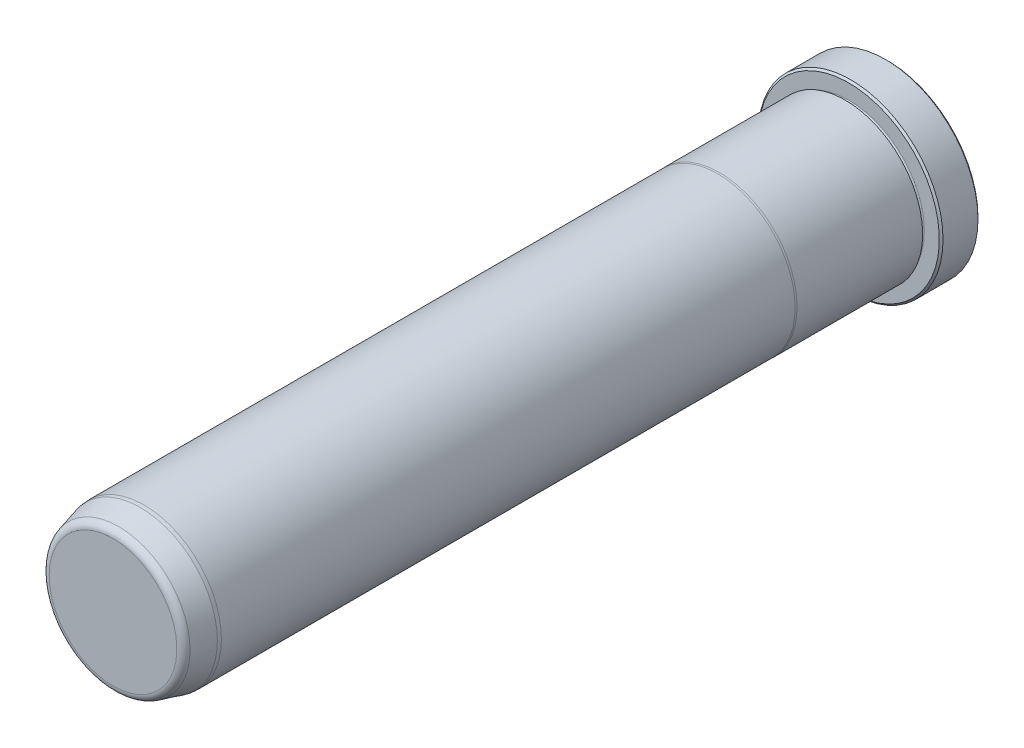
ISO-10303-21;
HEADER;
FILE_DESCRIPTION(('STEP AP214'),'2;1');
FILE_NAME('part.step','',(''),(''),'','','');
FILE_SCHEMA(('AUTOMOTIVE_DESIGN { 1 0 10303 214 1 1 1 1 }'));
ENDSEC;
DATA;
#1=APPLICATION_CONTEXT('core data for automotive mechanical design processes');
#2=APPLICATION_PROTOCOL_DEFINITION('international standard','automotive_design',2000,#1);
#3=PRODUCT_CONTEXT('',#1,'mechanical');
#4=PRODUCT('Part','Part','',(#3));
#5=PRODUCT_RELATED_PRODUCT_CATEGORY('part','',(#4));
#6=PRODUCT_DEFINITION_FORMATION('','',#4);
#7=PRODUCT_DEFINITION_CONTEXT('part definition',#1,'design');
#8=PRODUCT_DEFINITION('design','',#6,#7);
#9=PRODUCT_DEFINITION_SHAPE('','',#8);
#10=(LENGTH_UNIT() NAMED_UNIT(*) SI_UNIT(.MILLI.,.METRE.));
#11=(NAMED_UNIT(*) PLANE_ANGLE_UNIT() SI_UNIT($,.RADIAN.));
#12=(NAMED_UNIT(*) SI_UNIT($,.STERADIAN.) SOLID_ANGLE_UNIT());
#13=UNCERTAINTY_MEASURE_WITH_UNIT(LENGTH_MEASURE(1.E-05),#10,'distance_accuracy_value','');
#14=(GEOMETRIC_REPRESENTATION_CONTEXT(3) GLOBAL_UNCERTAINTY_ASSIGNED_CONTEXT((#13)) GLOBAL_UNIT_ASSIGNED_CONTEXT((#10,
#11,#12)) REPRESENTATION_CONTEXT('',''));
#15=CARTESIAN_POINT('',(0.,0.,0.));
#16=DIRECTION('',(0.,0.,1.));
#17=DIRECTION('',(1.,0.,0.));
#18=AXIS2_PLACEMENT_3D('',#15,#16,#17);
#19=CARTESIAN_POINT('',(0.,0.,0.));
#20=DIRECTION('',(0.,0.,1.));
#21=DIRECTION('',(1.,0.,0.));
#22=AXIS2_PLACEMENT_3D('',#19,#20,#21);
#23=PLANE('',#22);
#24=CARTESIAN_POINT('',(0.,0.,0.));
#25=DIRECTION('',(0.,0.,1.));
#26=DIRECTION('',(1.,0.,0.));
#27=AXIS2_PLACEMENT_3D('',#24,#25,#26);
#28=CIRCLE('',#27,18.542);
#29=CARTESIAN_POINT('',(18.542,0.,0.));
#30=VERTEX_POINT('',#29);
#31=EDGE_CURVE('E37',#30,#30,#28,.F.);
#32=ORIENTED_EDGE('',*,*,#31,.T.);
#33=EDGE_LOOP('',(#32));
#34=FACE_BOUND('',#33,.T.);
#35=ADVANCED_FACE('F30',(#34),#23,.F.);
#36=CARTESIAN_POINT('',(0.,0.,0.));
#37=DIRECTION('',(0.,0.,1.));
#38=DIRECTION('',(1.,0.,0.));
#39=AXIS2_PLACEMENT_3D('',#36,#37,#38);
#40=CYLINDRICAL_SURFACE('',#39,18.923);
#41=CARTESIAN_POINT('',(0.,0.,0.381000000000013));
#42=DIRECTION('',(0.,0.,1.));
#43=DIRECTION('',(1.,0.,0.));
#44=AXIS2_PLACEMENT_3D('',#41,#42,#43);
#45=CIRCLE('',#44,18.923);
#46=CARTESIAN_POINT('',(18.923,0.,0.381000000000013));
#47=VERTEX_POINT('',#46);
#48=EDGE_CURVE('E41',#47,#47,#45,.T.);
#49=ORIENTED_EDGE('',*,*,#48,.T.);
#50=EDGE_LOOP('',(#49));
#51=FACE_BOUND('',#50,.T.);
#52=CARTESIAN_POINT('',(0.,0.,7.54380000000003));
#53=DIRECTION('',(0.,0.,-1.));
#54=DIRECTION('',(-1.,0.,0.));
#55=AXIS2_PLACEMENT_3D('',#52,#53,#54);
#56=CIRCLE('',#55,18.923);
#57=CARTESIAN_POINT('',(-18.923,0.,7.54380000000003));
#58=VERTEX_POINT('',#57);
#59=EDGE_CURVE('E45',#58,#58,#56,.T.);
#60=ORIENTED_EDGE('',*,*,#59,.T.);
#61=EDGE_LOOP('',(#60));
#62=FACE_BOUND('',#61,.T.);
#63=ADVANCED_FACE('F118',(#51,#62),#40,.T.);
#64=CARTESIAN_POINT('',(0.,18.923,7.9248));
#65=DIRECTION('',(0.,0.,-1.));
#66=DIRECTION('',(-1.,0.,0.));
#67=AXIS2_PLACEMENT_3D('',#64,#65,#66);
#68=PLANE('',#67);
#69=CARTESIAN_POINT('',(0.,0.,7.9248));
#70=DIRECTION('',(0.,0.,-1.));
#71=DIRECTION('',(-1.,0.,0.));
#72=AXIS2_PLACEMENT_3D('',#69,#70,#71);
#73=CIRCLE('',#72,18.542);
#74=CARTESIAN_POINT('',(-18.542,0.,7.9248));
#75=VERTEX_POINT('',#74);
#76=EDGE_CURVE('E10',#75,#75,#73,.F.);
#77=ORIENTED_EDGE('',*,*,#76,.T.);
#78=EDGE_LOOP('',(#77));
#79=FACE_BOUND('',#78,.T.);
#80=CARTESIAN_POINT('',(0.,0.,7.9248));
#81=DIRECTION('',(0.,0.,1.));
#82=DIRECTION('',(1.,0.,0.));
#83=AXIS2_PLACEMENT_3D('',#80,#81,#82);
#84=CIRCLE('',#83,15.4813);
#85=CARTESIAN_POINT('',(15.4813,0.,7.9248));
#86=VERTEX_POINT('',#85);
#87=EDGE_CURVE('E56',#86,#86,#84,.T.);
#88=ORIENTED_EDGE('',*,*,#87,.F.);
#89=EDGE_LOOP('',(#88));
#90=FACE_BOUND('',#89,.T.);
#91=ADVANCED_FACE('F113',(#79,#90),#68,.F.);
#92=CARTESIAN_POINT('',(0.,0.,8.3058));
#93=DIRECTION('',(0.,0.,1.));
#94=DIRECTION('',(1.,0.,0.));
#95=AXIS2_PLACEMENT_3D('',#92,#93,#94);
#96=TOROIDAL_SURFACE('',#95,15.4813,0.381000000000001);
#97=CARTESIAN_POINT('',(0.,0.,8.6868));
#98=DIRECTION('',(0.,0.,1.));
#99=DIRECTION('',(1.,0.,0.));
#100=AXIS2_PLACEMENT_3D('',#97,#98,#99);
#101=CIRCLE('',#100,15.4813);
#102=CARTESIAN_POINT('',(15.4813,0.,8.6868));
#103=VERTEX_POINT('',#102);
#104=EDGE_CURVE('E59',#103,#103,#101,.T.);
#105=ORIENTED_EDGE('',*,*,#104,.F.);
#106=EDGE_LOOP('',(#105));
#107=FACE_BOUND('',#106,.T.);
#108=ORIENTED_EDGE('',*,*,#87,.T.);
#109=EDGE_LOOP('',(#108));
#110=FACE_BOUND('',#109,.T.);
#111=ADVANCED_FACE('F107',(#107,#110),#96,.F.);
#112=CARTESIAN_POINT('',(0.,15.4813,8.6868));
#113=DIRECTION('',(0.,0.,1.));
#114=DIRECTION('',(1.,0.,0.));
#115=AXIS2_PLACEMENT_3D('',#112,#113,#114);
#116=PLANE('',#115);
#117=CARTESIAN_POINT('',(0.,0.,8.6868));
#118=DIRECTION('',(0.,0.,1.));
#119=DIRECTION('',(1.,0.,0.));
#120=AXIS2_PLACEMENT_3D('',#117,#118,#119);
#121=CIRCLE('',#120,15.8877);
#122=CARTESIAN_POINT('',(15.8877,0.,8.6868));
#123=VERTEX_POINT('',#122);
#124=EDGE_CURVE('E62',#123,#123,#121,.T.);
#125=ORIENTED_EDGE('',*,*,#124,.F.);
#126=EDGE_LOOP('',(#125));
#127=FACE_BOUND('',#126,.T.);
#128=ORIENTED_EDGE('',*,*,#104,.T.);
#129=EDGE_LOOP('',(#128));
#130=FACE_BOUND('',#129,.T.);
#131=ADVANCED_FACE('F101',(#127,#130),#116,.F.);
#132=CARTESIAN_POINT('',(0.,0.,0.));
#133=DIRECTION('',(0.,0.,1.));
#134=DIRECTION('',(1.,0.,0.));
#135=AXIS2_PLACEMENT_3D('',#132,#133,#134);
#136=CYLINDRICAL_SURFACE('',#135,15.8877);
#137=CARTESIAN_POINT('',(0.,0.,34.4347630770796));
#138=DIRECTION('',(0.,0.,1.));
#139=DIRECTION('',(1.,0.,0.));
#140=AXIS2_PLACEMENT_3D('',#137,#138,#139);
#141=CIRCLE('',#140,15.8877);
#142=CARTESIAN_POINT('',(15.8877,0.,34.4347630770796));
#143=VERTEX_POINT('',#142);
#144=EDGE_CURVE('E65',#143,#143,#141,.T.);
#145=ORIENTED_EDGE('',*,*,#144,.F.);
#146=EDGE_LOOP('',(#145));
#147=FACE_BOUND('',#146,.T.);
#148=ORIENTED_EDGE('',*,*,#124,.T.);
#149=EDGE_LOOP('',(#148));
#150=FACE_BOUND('',#149,.T.);
#151=ADVANCED_FACE('F95',(#147,#150),#136,.T.);
#152=CARTESIAN_POINT('',(0.,0.,34.4347630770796));
#153=DIRECTION('',(0.,0.,-1.));
#154=DIRECTION('',(-1.,0.,0.));
#155=AXIS2_PLACEMENT_3D('',#152,#153,#154);
#156=CONICAL_SURFACE('',#155,15.8877,0.0698131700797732);
#157=CARTESIAN_POINT('',(0.,0.,34.798));
#158=DIRECTION('',(0.,0.,1.));
#159=DIRECTION('',(1.,0.,0.));
#160=AXIS2_PLACEMENT_3D('',#157,#158,#159);
#161=CIRCLE('',#160,15.8623);
#162=CARTESIAN_POINT('',(15.8623,0.,34.798));
#163=VERTEX_POINT('',#162);
#164=EDGE_CURVE('E68',#163,#163,#161,.T.);
#165=ORIENTED_EDGE('',*,*,#164,.F.);
#166=EDGE_LOOP('',(#165));
#167=FACE_BOUND('',#166,.T.);
#168=ORIENTED_EDGE('',*,*,#144,.T.);
#169=EDGE_LOOP('',(#168));
#170=FACE_BOUND('',#169,.T.);
#171=ADVANCED_FACE('F89',(#167,#170),#156,.T.);
#172=CARTESIAN_POINT('',(0.,0.,0.));
#173=DIRECTION('',(0.,0.,1.));
#174=DIRECTION('',(1.,0.,0.));
#175=AXIS2_PLACEMENT_3D('',#172,#173,#174);
#176=CYLINDRICAL_SURFACE('',#175,15.8623);
#177=CARTESIAN_POINT('',(0.,0.,152.4));
#178=DIRECTION('',(0.,0.,1.));
#179=DIRECTION('',(1.,0.,0.));
#180=AXIS2_PLACEMENT_3D('',#177,#178,#179);
#181=CIRCLE('',#180,15.8623);
#182=CARTESIAN_POINT('',(15.8623,0.,152.4));
#183=VERTEX_POINT('',#182);
#184=EDGE_CURVE('E71',#183,#183,#181,.T.);
#185=ORIENTED_EDGE('',*,*,#184,.F.);
#186=EDGE_LOOP('',(#185));
#187=FACE_BOUND('',#186,.T.);
#188=ORIENTED_EDGE('',*,*,#164,.T.);
#189=EDGE_LOOP('',(#188));
#190=FACE_BOUND('',#189,.T.);
#191=ADVANCED_FACE('F83',(#187,#190),#176,.T.);
#192=CARTESIAN_POINT('',(0.,0.,152.4));
#193=DIRECTION('',(0.,0.,-1.));
#194=DIRECTION('',(-1.,0.,0.));
#195=AXIS2_PLACEMENT_3D('',#192,#193,#194);
#196=CONICAL_SURFACE('',#195,15.8623,0.0872664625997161);
#197=CARTESIAN_POINT('',(0.,0.,153.162));
#198=DIRECTION('',(0.,0.,1.));
#199=DIRECTION('',(1.,0.,0.));
#200=AXIS2_PLACEMENT_3D('',#197,#198,#199);
#201=CIRCLE('',#200,15.7956336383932);
#202=CARTESIAN_POINT('',(15.7956336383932,0.,153.162));
#203=VERTEX_POINT('',#202);
#204=EDGE_CURVE('E74',#203,#203,#201,.T.);
#205=ORIENTED_EDGE('',*,*,#204,.F.);
#206=EDGE_LOOP('',(#205));
#207=FACE_BOUND('',#206,.T.);
#208=ORIENTED_EDGE('',*,*,#184,.T.);
#209=EDGE_LOOP('',(#208));
#210=FACE_BOUND('',#209,.T.);
#211=ADVANCED_FACE('F80',(#207,#210),#196,.T.);
#212=CARTESIAN_POINT('',(0.,0.,153.162));
#213=DIRECTION('',(0.,0.,-1.));
#214=DIRECTION('',(-1.,0.,0.));
#215=AXIS2_PLACEMENT_3D('',#212,#213,#214);
#216=CONICAL_SURFACE('',#215,15.7956336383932,0.26179938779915);
#217=CARTESIAN_POINT('',(0.,0.,157.5733752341));
#218=DIRECTION('',(0.,0.,1.));
#219=DIRECTION('',(1.,0.,0.));
#220=AXIS2_PLACEMENT_3D('',#217,#218,#219);
#221=CIRCLE('',#220,14.6136092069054);
#222=CARTESIAN_POINT('',(14.6136092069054,0.,157.5733752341));
#223=VERTEX_POINT('',#222);
#224=EDGE_CURVE('E50',#223,#223,#221,.F.);
#225=ORIENTED_EDGE('',*,*,#224,.T.);
#226=EDGE_LOOP('',(#225));
#227=FACE_BOUND('',#226,.T.);
#228=ORIENTED_EDGE('',*,*,#204,.T.);
#229=EDGE_LOOP('',(#228));
#230=FACE_BOUND('',#229,.T.);
#231=ADVANCED_FACE('F78',(#227,#230),#216,.T.);
#232=CARTESIAN_POINT('',(0.,14.2983335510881,158.75));
#233=DIRECTION('',(0.,0.,-1.));
#234=DIRECTION('',(-1.,0.,0.));
#235=AXIS2_PLACEMENT_3D('',#232,#233,#234);
#236=PLANE('',#235);
#237=CARTESIAN_POINT('',(0.,0.,158.75));
#238=DIRECTION('',(0.,0.,-1.));
#239=DIRECTION('',(-1.,0.,0.));
#240=AXIS2_PLACEMENT_3D('',#237,#238,#239);
#241=CIRCLE('',#240,13.0802019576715);
#242=CARTESIAN_POINT('',(-13.0802019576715,0.,158.75));
#243=VERTEX_POINT('',#242);
#244=EDGE_CURVE('E53',#243,#243,#241,.F.);
#245=ORIENTED_EDGE('',*,*,#244,.T.);
#246=EDGE_LOOP('',(#245));
#247=FACE_BOUND('',#246,.T.);
#248=ADVANCED_FACE('F133',(#247),#236,.F.);
#249=CARTESIAN_POINT('',(0.,0.,157.1625));
#250=DIRECTION('',(0.,0.,-1.));
#251=DIRECTION('',(-1.,0.,0.));
#252=AXIS2_PLACEMENT_3D('',#249,#250,#251);
#253=TOROIDAL_SURFACE('',#252,13.0802019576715,1.5875);
#254=ORIENTED_EDGE('',*,*,#224,.F.);
#255=EDGE_LOOP('',(#254));
#256=FACE_BOUND('',#255,.T.);
#257=ORIENTED_EDGE('',*,*,#244,.F.);
#258=EDGE_LOOP('',(#257));
#259=FACE_BOUND('',#258,.T.);
#260=ADVANCED_FACE('F130',(#256,#259),#253,.T.);
#261=CARTESIAN_POINT('',(0.,0.,0.381000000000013));
#262=DIRECTION('',(0.,0.,1.));
#263=DIRECTION('',(1.,0.,0.));
#264=AXIS2_PLACEMENT_3D('',#261,#262,#263);
#265=CONICAL_SURFACE('',#264,18.923,0.785398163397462);
#266=ORIENTED_EDGE('',*,*,#31,.F.);
#267=EDGE_LOOP('',(#266));
#268=FACE_BOUND('',#267,.T.);
#269=ORIENTED_EDGE('',*,*,#48,.F.);
#270=EDGE_LOOP('',(#269));
#271=FACE_BOUND('',#270,.T.);
#272=ADVANCED_FACE('F132',(#268,#271),#265,.T.);
#273=CARTESIAN_POINT('',(0.,0.,7.9248));
#274=DIRECTION('',(0.,0.,-1.));
#275=DIRECTION('',(-1.,0.,0.));
#276=AXIS2_PLACEMENT_3D('',#273,#274,#275);
#277=CONICAL_SURFACE('',#276,18.542,0.785398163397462);
#278=ORIENTED_EDGE('',*,*,#59,.F.);
#279=EDGE_LOOP('',(#278));
#280=FACE_BOUND('',#279,.T.);
#281=ORIENTED_EDGE('',*,*,#76,.F.);
#282=EDGE_LOOP('',(#281));
#283=FACE_BOUND('',#282,.T.);
#284=ADVANCED_FACE('F32',(#280,#283),#277,.T.);
#285=CLOSED_SHELL('',(#35,#63,#91,#111,#131,#151,#171,#191,#211,#231,#248,#260,#272,#284));
#286=MANIFOLD_SOLID_BREP('B2',#285);
#287=ADVANCED_BREP_SHAPE_REPRESENTATION('',(#18,#286),#14);
#288=SHAPE_DEFINITION_REPRESENTATION(#9,#287);
ENDSEC;
END-ISO-10303-21;
